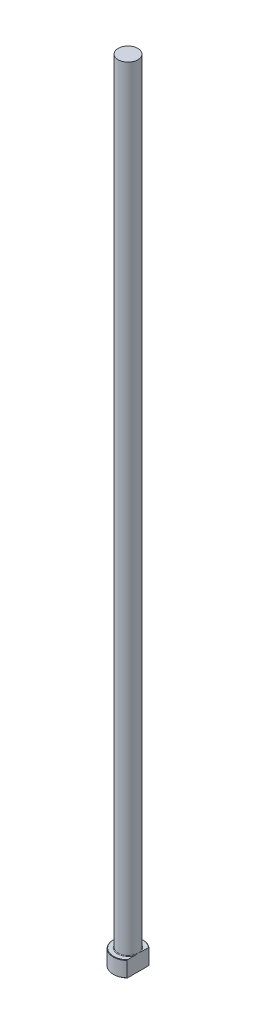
from build123d import *
from build123d.topology import SkipClean

# Parameters (mm, degrees)
CHAMFER1_SIZE    = 0.2
FILLET1_R        = 0.3
KEYED_HEAD_DEPTH = 401.140600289


with BuildPart() as part:
    # Sketch1 → Revolve1 (revolve)
    with BuildSketch(Plane.XY, mode=Mode.PRIVATE) as revolve1_sk:
        Polygon((0, 0), (-7.5, 0), (-7.5, 8), (-5, 8), (-5, 400), (0, 400), align=None)
    revolve(revolve1_sk.sketch.rotate(Axis((0, 259.958771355, 0), (0, -1, 0)), 270), axis=Axis((0, 259.958771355, 0), (0, -1, 0)))

    # Chamfer1
    chamfer1_edges = [part.edges().sort_by_distance(p)[0] for p in [
        (0, 8, -7.5),
        (0, 0, -7.5),
    ]]
    chamfer(chamfer1_edges, length=CHAMFER1_SIZE)

    # Fillet1
    fillet1_edges = [part.edges().sort_by_distance(p)[0] for p in [
        (0, 8, -5),
    ]]
    fillet(fillet1_edges, radius=FILLET1_R)

    # Sketch2 → KEYED HEAD (cut, through all)
    with SkipClean():  # the faces are left unmerged after this step: merging them gives an invalid solid
        with BuildSketch(Plane(origin=(0, 0, 0), x_dir=(1, 0, 0), z_dir=(0, 1, 0))):
            with BuildLine():
                Line((5, -5.590169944), (5, 5.590169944))
                ThreePointArc((5, 5.590169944), (7.5, 0), (5, -5.590169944))
            make_face()
        extrude(amount=KEYED_HEAD_DEPTH, mode=Mode.SUBTRACT)


solid = part.part
